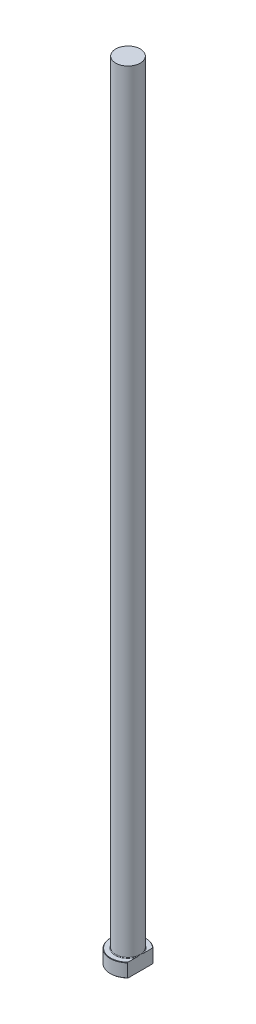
ISO-10303-21;
HEADER;
FILE_DESCRIPTION(('STEP AP214'),'2;1');
FILE_NAME('part.step','',(''),(''),'','','');
FILE_SCHEMA(('AUTOMOTIVE_DESIGN { 1 0 10303 214 1 1 1 1 }'));
ENDSEC;
DATA;
#1=APPLICATION_CONTEXT('core data for automotive mechanical design processes');
#2=APPLICATION_PROTOCOL_DEFINITION('international standard','automotive_design',2000,#1);
#3=PRODUCT_CONTEXT('',#1,'mechanical');
#4=PRODUCT('Part','Part','',(#3));
#5=PRODUCT_RELATED_PRODUCT_CATEGORY('part','',(#4));
#6=PRODUCT_DEFINITION_FORMATION('','',#4);
#7=PRODUCT_DEFINITION_CONTEXT('part definition',#1,'design');
#8=PRODUCT_DEFINITION('design','',#6,#7);
#9=PRODUCT_DEFINITION_SHAPE('','',#8);
#10=(LENGTH_UNIT() NAMED_UNIT(*) SI_UNIT(.MILLI.,.METRE.));
#11=(NAMED_UNIT(*) PLANE_ANGLE_UNIT() SI_UNIT($,.RADIAN.));
#12=(NAMED_UNIT(*) SI_UNIT($,.STERADIAN.) SOLID_ANGLE_UNIT());
#13=UNCERTAINTY_MEASURE_WITH_UNIT(LENGTH_MEASURE(1.E-05),#10,'distance_accuracy_value','');
#14=(GEOMETRIC_REPRESENTATION_CONTEXT(3) GLOBAL_UNCERTAINTY_ASSIGNED_CONTEXT((#13)) GLOBAL_UNIT_ASSIGNED_CONTEXT((#10,
#11,#12)) REPRESENTATION_CONTEXT('',''));
#15=CARTESIAN_POINT('',(0.,0.,0.));
#16=DIRECTION('',(0.,0.,1.));
#17=DIRECTION('',(1.,0.,0.));
#18=AXIS2_PLACEMENT_3D('',#15,#16,#17);
#19=CARTESIAN_POINT('',(0.,0.,0.));
#20=DIRECTION('',(0.,-1.,0.));
#21=DIRECTION('',(0.,0.,-1.));
#22=AXIS2_PLACEMENT_3D('',#19,#20,#21);
#23=PLANE('',#22);
#24=CARTESIAN_POINT('',(0.,0.,0.));
#25=DIRECTION('',(0.,-1.,0.));
#26=DIRECTION('',(0.,0.,-1.));
#27=AXIS2_PLACEMENT_3D('',#24,#25,#26);
#28=CIRCLE('',#27,8.79999999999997);
#29=CARTESIAN_POINT('',(6.24999999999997,0.,6.19495762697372));
#30=VERTEX_POINT('',#29);
#31=CARTESIAN_POINT('',(6.24999999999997,0.,-6.19495762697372));
#32=VERTEX_POINT('',#31);
#33=EDGE_CURVE('E98',#30,#32,#28,.T.);
#34=ORIENTED_EDGE('',*,*,#33,.T.);
#35=DIRECTION('',(0.,0.,1.));
#36=VECTOR('',#35,1.);
#37=CARTESIAN_POINT('',(6.24999999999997,0.,-6.47591692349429));
#38=LINE('',#37,#36);
#39=EDGE_CURVE('E83',#32,#30,#38,.T.);
#40=ORIENTED_EDGE('',*,*,#39,.T.);
#41=EDGE_LOOP('',(#34,#40));
#42=FACE_BOUND('',#41,.T.);
#43=ADVANCED_FACE('F32',(#42),#23,.T.);
#44=CARTESIAN_POINT('',(0.,259.958771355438,0.));
#45=DIRECTION('',(0.,1.,0.));
#46=DIRECTION('',(0.,0.,1.));
#47=AXIS2_PLACEMENT_3D('',#44,#45,#46);
#48=CYLINDRICAL_SURFACE('',#47,8.99999999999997);
#49=CARTESIAN_POINT('',(0.,6.79999999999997,0.));
#50=DIRECTION('',(0.,1.,0.));
#51=DIRECTION('',(0.,0.,1.));
#52=AXIS2_PLACEMENT_3D('',#49,#50,#51);
#53=CIRCLE('',#52,8.99999999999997);
#54=CARTESIAN_POINT('',(6.24999999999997,6.79999999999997,6.47591692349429));
#55=VERTEX_POINT('',#54);
#56=CARTESIAN_POINT('',(6.24999999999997,6.79999999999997,-6.47591692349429));
#57=VERTEX_POINT('',#56);
#58=EDGE_CURVE('E104',#55,#57,#53,.F.);
#59=ORIENTED_EDGE('',*,*,#58,.T.);
#60=DIRECTION('',(0.,-1.,0.));
#61=VECTOR('',#60,1.);
#62=CARTESIAN_POINT('',(6.24999999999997,400.,-6.47591692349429));
#63=LINE('',#62,#61);
#64=CARTESIAN_POINT('',(6.24999999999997,0.200000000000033,-6.47591692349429));
#65=VERTEX_POINT('',#64);
#66=EDGE_CURVE('E183',#57,#65,#63,.T.);
#67=ORIENTED_EDGE('',*,*,#66,.T.);
#68=CARTESIAN_POINT('',(0.,0.200000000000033,0.));
#69=DIRECTION('',(0.,-1.,0.));
#70=DIRECTION('',(0.,0.,-1.));
#71=AXIS2_PLACEMENT_3D('',#68,#69,#70);
#72=CIRCLE('',#71,8.99999999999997);
#73=CARTESIAN_POINT('',(6.24999999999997,0.200000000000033,6.47591692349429));
#74=VERTEX_POINT('',#73);
#75=EDGE_CURVE('E100',#65,#74,#72,.F.);
#76=ORIENTED_EDGE('',*,*,#75,.T.);
#77=DIRECTION('',(0.,-1.,0.));
#78=VECTOR('',#77,1.);
#79=CARTESIAN_POINT('',(6.24999999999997,400.,6.47591692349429));
#80=LINE('',#79,#78);
#81=EDGE_CURVE('E93',#55,#74,#80,.T.);
#82=ORIENTED_EDGE('',*,*,#81,.F.);
#83=EDGE_LOOP('',(#59,#67,#76,#82));
#84=FACE_BOUND('',#83,.T.);
#85=ADVANCED_FACE('F158',(#84),#48,.T.);
#86=CARTESIAN_POINT('',(-8.99999999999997,7.,0.));
#87=DIRECTION('',(0.,1.,0.));
#88=DIRECTION('',(0.,0.,1.));
#89=AXIS2_PLACEMENT_3D('',#86,#87,#88);
#90=PLANE('',#89);
#91=CARTESIAN_POINT('',(0.,7.,0.));
#92=DIRECTION('',(0.,1.,0.));
#93=DIRECTION('',(0.,0.,1.));
#94=AXIS2_PLACEMENT_3D('',#91,#92,#93);
#95=CIRCLE('',#94,8.79999999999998);
#96=CARTESIAN_POINT('',(6.24999999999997,7.,-6.19495762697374));
#97=VERTEX_POINT('',#96);
#98=CARTESIAN_POINT('',(6.24999999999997,7.,6.19495762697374));
#99=VERTEX_POINT('',#98);
#100=EDGE_CURVE('E178',#97,#99,#95,.T.);
#101=ORIENTED_EDGE('',*,*,#100,.T.);
#102=DIRECTION('',(0.,0.,-1.));
#103=VECTOR('',#102,1.);
#104=CARTESIAN_POINT('',(6.24999999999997,7.,0.));
#105=LINE('',#104,#103);
#106=CARTESIAN_POINT('',(6.24999999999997,6.99999999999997,1.95959179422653));
#107=VERTEX_POINT('',#106);
#108=EDGE_CURVE('E57',#99,#107,#105,.T.);
#109=ORIENTED_EDGE('',*,*,#108,.T.);
#110=CARTESIAN_POINT('',(0.,7.,0.));
#111=DIRECTION('',(0.,1.,0.));
#112=DIRECTION('',(0.,0.,1.));
#113=AXIS2_PLACEMENT_3D('',#110,#111,#112);
#114=CIRCLE('',#113,6.54999999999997);
#115=CARTESIAN_POINT('',(6.24999999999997,6.99999999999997,-1.95959179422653));
#116=VERTEX_POINT('',#115);
#117=EDGE_CURVE('E107',#107,#116,#114,.F.);
#118=ORIENTED_EDGE('',*,*,#117,.T.);
#119=EDGE_CURVE('E136',#116,#97,#105,.T.);
#120=ORIENTED_EDGE('',*,*,#119,.T.);
#121=EDGE_LOOP('',(#101,#109,#118,#120));
#122=FACE_BOUND('',#121,.T.);
#123=ADVANCED_FACE('F147',(#122),#90,.T.);
#124=CARTESIAN_POINT('',(0.,7.00000000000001,0.));
#125=DIRECTION('',(0.,-1.,0.));
#126=DIRECTION('',(0.,0.,-1.));
#127=AXIS2_PLACEMENT_3D('',#124,#125,#126);
#128=CONICAL_SURFACE('',#127,8.79999999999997,0.785398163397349);
#129=ORIENTED_EDGE('',*,*,#58,.F.);
#130=CARTESIAN_POINT('',(6.24999999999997,0.241333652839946,14.2481436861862));
#131=CARTESIAN_POINT('',(6.24999999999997,0.433510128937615,14.0382871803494));
#132=CARTESIAN_POINT('',(6.24999999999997,0.625318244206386,13.8280934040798));
#133=CARTESIAN_POINT('',(6.24999999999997,1.00808847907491,13.4069339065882));
#134=CARTESIAN_POINT('',(6.24999999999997,1.19905059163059,13.1959681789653));
#135=CARTESIAN_POINT('',(6.24999999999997,1.77058893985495,12.561672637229));
#136=CARTESIAN_POINT('',(6.24999999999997,2.14972657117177,12.1370432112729));
#137=CARTESIAN_POINT('',(6.24999999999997,2.90544742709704,11.2804244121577));
#138=CARTESIAN_POINT('',(6.24999999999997,3.28199640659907,10.848404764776));
#139=CARTESIAN_POINT('',(6.24999999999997,4.02800319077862,9.97835973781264));
#140=CARTESIAN_POINT('',(6.24999999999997,4.39746188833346,9.5403351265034));
#141=CARTESIAN_POINT('',(6.24999999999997,5.06619556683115,8.7290203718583));
#142=CARTESIAN_POINT('',(6.24999999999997,5.36698522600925,8.35698524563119));
#143=CARTESIAN_POINT('',(6.24999999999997,5.81091107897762,7.79312105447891));
#144=CARTESIAN_POINT('',(6.24999999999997,5.95769918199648,7.60416746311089));
#145=CARTESIAN_POINT('',(6.24999999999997,6.24834991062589,7.22402635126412));
#146=CARTESIAN_POINT('',(6.24999999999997,6.39221261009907,7.03283888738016));
#147=CARTESIAN_POINT('',(6.24999999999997,6.67624882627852,6.64809388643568));
#148=CARTESIAN_POINT('',(6.24999999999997,6.81642658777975,6.45453948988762));
#149=CARTESIAN_POINT('',(6.24999999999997,7.09250069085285,6.06440831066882));
#150=CARTESIAN_POINT('',(6.24999999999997,7.22839726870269,5.86783169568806));
#151=CARTESIAN_POINT('',(6.24999999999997,7.49487226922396,5.47121725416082));
#152=CARTESIAN_POINT('',(6.24999999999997,7.62545297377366,5.27118096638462));
#153=CARTESIAN_POINT('',(6.24999999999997,7.8800575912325,4.86699392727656));
#154=CARTESIAN_POINT('',(6.24999999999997,8.0040823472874,4.66284370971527));
#155=CARTESIAN_POINT('',(6.24999999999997,8.24192682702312,4.25315549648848));
#156=CARTESIAN_POINT('',(6.24999999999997,8.35588135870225,4.04769623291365));
#157=CARTESIAN_POINT('',(6.24999999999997,8.5737612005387,3.63145654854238));
#158=CARTESIAN_POINT('',(6.24999999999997,8.67768550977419,3.42067559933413));
#159=CARTESIAN_POINT('',(6.24999999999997,8.87268822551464,2.99352725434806));
#160=CARTESIAN_POINT('',(6.24999999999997,8.96378316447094,2.77716748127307));
#161=CARTESIAN_POINT('',(6.24999999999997,9.12997532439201,2.33835397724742));
#162=CARTESIAN_POINT('',(6.24999999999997,9.20507709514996,2.11590199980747));
#163=CARTESIAN_POINT('',(6.24999999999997,9.32245998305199,1.71047588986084));
#164=CARTESIAN_POINT('',(6.24999999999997,9.36830307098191,1.52853906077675));
#165=CARTESIAN_POINT('',(6.24999999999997,9.44550018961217,1.16159607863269));
#166=CARTESIAN_POINT('',(6.24999999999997,9.4768562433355,0.97659035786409));
#167=CARTESIAN_POINT('',(6.24999999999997,9.5234834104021,0.605004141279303));
#168=CARTESIAN_POINT('',(6.24999999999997,9.53879458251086,0.418428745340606));
#169=CARTESIAN_POINT('',(6.24999999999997,9.552630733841,0.0446485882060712));
#170=CARTESIAN_POINT('',(6.24999999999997,9.55115595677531,-0.142556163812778));
#171=CARTESIAN_POINT('',(6.24999999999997,9.53151010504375,-0.515964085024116));
#172=CARTESIAN_POINT('',(6.24999999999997,9.51334871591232,-0.702167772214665));
#173=CARTESIAN_POINT('',(6.24999999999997,9.46132296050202,-1.07235055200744));
#174=CARTESIAN_POINT('',(6.24999999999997,9.42745724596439,-1.25632945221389));
#175=CARTESIAN_POINT('',(6.24999999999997,9.34551825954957,-1.62161387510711));
#176=CARTESIAN_POINT('',(6.24999999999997,9.29740414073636,-1.80291011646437));
#177=CARTESIAN_POINT('',(6.24999999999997,9.1889194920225,-2.16174722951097));
#178=CARTESIAN_POINT('',(6.24999999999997,9.1285491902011,-2.33928817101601));
#179=CARTESIAN_POINT('',(6.24999999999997,8.98038960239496,-2.73619642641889));
#180=CARTESIAN_POINT('',(6.24999999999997,8.88955370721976,-2.95442044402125));
#181=CARTESIAN_POINT('',(6.24999999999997,8.69480317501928,-3.3850000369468));
#182=CARTESIAN_POINT('',(6.24999999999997,8.59088203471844,-3.59735262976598));
#183=CARTESIAN_POINT('',(6.24999999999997,8.37253952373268,-4.01706977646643));
#184=CARTESIAN_POINT('',(6.24999999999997,8.25809823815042,-4.22442389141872));
#185=CARTESIAN_POINT('',(6.24999999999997,8.02107167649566,-4.63434772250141));
#186=CARTESIAN_POINT('',(6.24999999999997,7.898487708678,-4.83691820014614));
#187=CARTESIAN_POINT('',(6.24999999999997,7.64548625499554,-5.24008406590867));
#188=CARTESIAN_POINT('',(6.24999999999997,7.51499955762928,-5.4406358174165));
#189=CARTESIAN_POINT('',(6.24999999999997,7.24868510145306,-5.83817237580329));
#190=CARTESIAN_POINT('',(6.24999999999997,7.11285688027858,-6.03515687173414));
#191=CARTESIAN_POINT('',(6.24999999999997,6.83683288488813,-6.42612120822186));
#192=CARTESIAN_POINT('',(6.24999999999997,6.69663581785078,-6.62010013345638));
#193=CARTESIAN_POINT('',(6.24999999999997,6.41268260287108,-7.00543858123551));
#194=CARTESIAN_POINT('',(6.24999999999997,6.26892633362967,-7.19679801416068));
#195=CARTESIAN_POINT('',(6.24999999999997,5.89056224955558,-7.69242940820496));
#196=CARTESIAN_POINT('',(6.24999999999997,5.65363599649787,-7.99493062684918));
#197=CARTESIAN_POINT('',(6.24999999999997,5.17412949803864,-8.59529922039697));
#198=CARTESIAN_POINT('',(6.24999999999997,4.93155037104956,-8.89316749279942));
#199=CARTESIAN_POINT('',(6.24999999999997,4.44181409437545,-9.48544309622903));
#200=CARTESIAN_POINT('',(6.24999999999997,4.19465400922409,-9.77984799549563));
#201=CARTESIAN_POINT('',(6.24999999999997,3.69683790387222,-10.3657062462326));
#202=CARTESIAN_POINT('',(6.24999999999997,3.44618171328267,-10.6571594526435));
#203=CARTESIAN_POINT('',(6.24999999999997,2.95199448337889,-11.2262122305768));
#204=CARTESIAN_POINT('',(6.24999999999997,2.7085712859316,-11.5039055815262));
#205=CARTESIAN_POINT('',(6.24999999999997,2.21961081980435,-12.0574158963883));
#206=CARTESIAN_POINT('',(6.24999999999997,1.97407358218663,-12.3332328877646));
#207=CARTESIAN_POINT('',(6.24999999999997,1.48150971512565,-12.8829958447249));
#208=CARTESIAN_POINT('',(6.24999999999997,1.23448497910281,-13.1569435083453));
#209=CARTESIAN_POINT('',(6.24999999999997,0.738953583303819,-13.7034947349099));
#210=CARTESIAN_POINT('',(6.24999999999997,0.490446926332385,-13.9760983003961));
#211=CARTESIAN_POINT('',(6.24999999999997,0.241333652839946,-14.2481436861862));
#212=B_SPLINE_CURVE_WITH_KNOTS('',3,(#130,#131,#132,#133,#134,#135,#136,#137,#138,#139,#140,
#141,#142,#143,#144,#145,#146,#147,#148,#149,#150,#151,#152,#153,#154,#155,#156,#157,#158,#159,
#160,#161,#162,#163,#164,#165,#166,#167,#168,#169,#170,#171,#172,#173,#174,#175,#176,#177,#178,
#179,#180,#181,#182,#183,#184,#185,#186,#187,#188,#189,#190,#191,#192,#193,#194,#195,#196,#197,
#198,#199,#200,#201,#202,#203,#204,#205,#206,#207,#208,#209,#210,#211),.UNSPECIFIED.,.F.,.F.,(4,
2,2,2,2,2,2,2,2,2,2,2,2,2,2,2,2,2,2,2,2,2,2,2,2,2,2,2,2,2,2,2,2,2,2,2,2,2,2,2,4),(0.,
0.853664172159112,1.7073354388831,3.41508002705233,5.13429133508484,6.8532847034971,
8.28840776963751,9.00619588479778,9.72396585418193,10.4408691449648,11.1577328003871,
11.8742854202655,12.5907456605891,13.295361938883,14.0000484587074,14.7038184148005,
15.4073878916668,15.9697505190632,16.5320345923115,17.0929114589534,17.6537801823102,
18.2143235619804,18.7749150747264,19.3371294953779,19.8993334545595,20.6078926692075,
21.3168054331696,22.0270889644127,22.7372586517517,23.4549493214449,24.1727022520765,
24.8906696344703,25.6086615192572,26.7612833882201,27.9136791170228,29.0668407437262,
30.2200587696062,31.3278889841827,32.4357029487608,33.5423213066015,34.6489375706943),.UNSPECIFIED.);
#213=EDGE_CURVE('E135',#55,#99,#212,.T.);
#214=ORIENTED_EDGE('',*,*,#213,.T.);
#215=ORIENTED_EDGE('',*,*,#100,.F.);
#216=EDGE_CURVE('E127',#97,#57,#212,.T.);
#217=ORIENTED_EDGE('',*,*,#216,.T.);
#218=EDGE_LOOP('',(#129,#214,#215,#217));
#219=FACE_BOUND('',#218,.T.);
#220=ADVANCED_FACE('F143',(#219),#128,.T.);
#221=CARTESIAN_POINT('',(0.,0.200000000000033,0.));
#222=DIRECTION('',(0.,1.,0.));
#223=DIRECTION('',(0.,0.,1.));
#224=AXIS2_PLACEMENT_3D('',#221,#222,#223);
#225=CONICAL_SURFACE('',#224,8.99999999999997,0.785398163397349);
#226=ORIENTED_EDGE('',*,*,#75,.F.);
#227=CARTESIAN_POINT('',(6.24999999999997,6.75866634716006,-14.2481436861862));
#228=CARTESIAN_POINT('',(6.24999999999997,6.56648987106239,-14.0382871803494));
#229=CARTESIAN_POINT('',(6.24999999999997,6.37468175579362,-13.8280934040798));
#230=CARTESIAN_POINT('',(6.24999999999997,5.99191152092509,-13.4069339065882));
#231=CARTESIAN_POINT('',(6.24999999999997,5.80094940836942,-13.1959681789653));
#232=CARTESIAN_POINT('',(6.24999999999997,5.22941106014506,-12.561672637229));
#233=CARTESIAN_POINT('',(6.24999999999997,4.85027342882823,-12.1370432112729));
#234=CARTESIAN_POINT('',(6.24999999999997,4.09455257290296,-11.2804244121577));
#235=CARTESIAN_POINT('',(6.24999999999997,3.71800359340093,-10.848404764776));
#236=CARTESIAN_POINT('',(6.24999999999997,2.97199680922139,-9.97835973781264));
#237=CARTESIAN_POINT('',(6.24999999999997,2.60253811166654,-9.5403351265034));
#238=CARTESIAN_POINT('',(6.24999999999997,1.93380443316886,-8.7290203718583));
#239=CARTESIAN_POINT('',(6.24999999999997,1.63301477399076,-8.35698524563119));
#240=CARTESIAN_POINT('',(6.24999999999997,1.18908892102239,-7.79312105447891));
#241=CARTESIAN_POINT('',(6.24999999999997,1.04230081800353,-7.60416746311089));
#242=CARTESIAN_POINT('',(6.24999999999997,0.75165008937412,-7.22402635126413));
#243=CARTESIAN_POINT('',(6.24999999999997,0.607787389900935,-7.03283888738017));
#244=CARTESIAN_POINT('',(6.24999999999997,0.323751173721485,-6.64809388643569));
#245=CARTESIAN_POINT('',(6.24999999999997,0.183573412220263,-6.45453948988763));
#246=CARTESIAN_POINT('',(6.24999999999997,-0.0925006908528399,-6.06440831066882));
#247=CARTESIAN_POINT('',(6.24999999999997,-0.228397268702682,-5.86783169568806));
#248=CARTESIAN_POINT('',(6.24999999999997,-0.494872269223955,-5.47121725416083));
#249=CARTESIAN_POINT('',(6.24999999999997,-0.625452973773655,-5.27118096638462));
#250=CARTESIAN_POINT('',(6.24999999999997,-0.880057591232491,-4.86699392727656));
#251=CARTESIAN_POINT('',(6.24999999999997,-1.00408234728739,-4.66284370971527));
#252=CARTESIAN_POINT('',(6.24999999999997,-1.24192682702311,-4.25315549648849));
#253=CARTESIAN_POINT('',(6.24999999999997,-1.35588135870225,-4.04769623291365));
#254=CARTESIAN_POINT('',(6.24999999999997,-1.57376120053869,-3.63145654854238));
#255=CARTESIAN_POINT('',(6.24999999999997,-1.67768550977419,-3.42067559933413));
#256=CARTESIAN_POINT('',(6.24999999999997,-1.87268822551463,-2.99352725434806));
#257=CARTESIAN_POINT('',(6.24999999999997,-1.96378316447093,-2.77716748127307));
#258=CARTESIAN_POINT('',(6.24999999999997,-2.129975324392,-2.33835397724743));
#259=CARTESIAN_POINT('',(6.24999999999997,-2.20507709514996,-2.11590199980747));
#260=CARTESIAN_POINT('',(6.24999999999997,-2.32245998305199,-1.71047588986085));
#261=CARTESIAN_POINT('',(6.24999999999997,-2.3683030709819,-1.52853906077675));
#262=CARTESIAN_POINT('',(6.24999999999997,-2.44550018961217,-1.1615960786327));
#263=CARTESIAN_POINT('',(6.24999999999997,-2.47685624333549,-0.976590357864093));
#264=CARTESIAN_POINT('',(6.24999999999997,-2.52348341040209,-0.605004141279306));
#265=CARTESIAN_POINT('',(6.24999999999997,-2.53879458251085,-0.418428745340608));
#266=CARTESIAN_POINT('',(6.24999999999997,-2.552630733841,-0.0446485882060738));
#267=CARTESIAN_POINT('',(6.24999999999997,-2.55115595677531,0.142556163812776));
#268=CARTESIAN_POINT('',(6.24999999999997,-2.53151010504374,0.515964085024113));
#269=CARTESIAN_POINT('',(6.24999999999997,-2.51334871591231,0.702167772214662));
#270=CARTESIAN_POINT('',(6.24999999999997,-2.46132296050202,1.07235055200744));
#271=CARTESIAN_POINT('',(6.24999999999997,-2.42745724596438,1.25632945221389));
#272=CARTESIAN_POINT('',(6.24999999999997,-2.34551825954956,1.62161387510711));
#273=CARTESIAN_POINT('',(6.24999999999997,-2.29740414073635,1.80291011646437));
#274=CARTESIAN_POINT('',(6.24999999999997,-2.1889194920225,2.16174722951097));
#275=CARTESIAN_POINT('',(6.24999999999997,-2.1285491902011,2.33928817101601));
#276=CARTESIAN_POINT('',(6.24999999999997,-1.98038960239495,2.73619642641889));
#277=CARTESIAN_POINT('',(6.24999999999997,-1.88955370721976,2.95442044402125));
#278=CARTESIAN_POINT('',(6.24999999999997,-1.69480317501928,3.3850000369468));
#279=CARTESIAN_POINT('',(6.24999999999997,-1.59088203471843,3.59735262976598));
#280=CARTESIAN_POINT('',(6.24999999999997,-1.37253952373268,4.01706977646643));
#281=CARTESIAN_POINT('',(6.24999999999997,-1.25809823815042,4.22442389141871));
#282=CARTESIAN_POINT('',(6.24999999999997,-1.02107167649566,4.6343477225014));
#283=CARTESIAN_POINT('',(6.24999999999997,-0.898487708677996,4.83691820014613));
#284=CARTESIAN_POINT('',(6.24999999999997,-0.645486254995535,5.24008406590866));
#285=CARTESIAN_POINT('',(6.24999999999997,-0.514999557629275,5.4406358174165));
#286=CARTESIAN_POINT('',(6.24999999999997,-0.24868510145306,5.83817237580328));
#287=CARTESIAN_POINT('',(6.24999999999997,-0.112856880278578,6.03515687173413));
#288=CARTESIAN_POINT('',(6.24999999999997,0.163167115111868,6.42612120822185));
#289=CARTESIAN_POINT('',(6.24999999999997,0.30336418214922,6.62010013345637));
#290=CARTESIAN_POINT('',(6.24999999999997,0.587317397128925,7.00543858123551));
#291=CARTESIAN_POINT('',(6.24999999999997,0.731073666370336,7.19679801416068));
#292=CARTESIAN_POINT('',(6.24999999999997,1.10943775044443,7.69242940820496));
#293=CARTESIAN_POINT('',(6.24999999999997,1.34636400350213,7.99493062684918));
#294=CARTESIAN_POINT('',(6.24999999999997,1.82587050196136,8.59529922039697));
#295=CARTESIAN_POINT('',(6.24999999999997,2.06844962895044,8.89316749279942));
#296=CARTESIAN_POINT('',(6.24999999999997,2.55818590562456,9.48544309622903));
#297=CARTESIAN_POINT('',(6.24999999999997,2.80534599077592,9.77984799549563));
#298=CARTESIAN_POINT('',(6.24999999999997,3.30316209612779,10.3657062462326));
#299=CARTESIAN_POINT('',(6.24999999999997,3.55381828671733,10.6571594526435));
#300=CARTESIAN_POINT('',(6.24999999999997,4.04800551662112,11.2262122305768));
#301=CARTESIAN_POINT('',(6.24999999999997,4.29142871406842,11.5039055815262));
#302=CARTESIAN_POINT('',(6.24999999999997,4.78038918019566,12.0574158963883));
#303=CARTESIAN_POINT('',(6.24999999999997,5.02592641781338,12.3332328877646));
#304=CARTESIAN_POINT('',(6.24999999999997,5.51849028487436,12.8829958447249));
#305=CARTESIAN_POINT('',(6.24999999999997,5.7655150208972,13.1569435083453));
#306=CARTESIAN_POINT('',(6.24999999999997,6.26104641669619,13.7034947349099));
#307=CARTESIAN_POINT('',(6.24999999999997,6.50955307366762,13.9760983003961));
#308=CARTESIAN_POINT('',(6.24999999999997,6.75866634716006,14.2481436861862));
#309=B_SPLINE_CURVE_WITH_KNOTS('',3,(#227,#228,#229,#230,#231,#232,#233,#234,#235,#236,#237,
#238,#239,#240,#241,#242,#243,#244,#245,#246,#247,#248,#249,#250,#251,#252,#253,#254,#255,#256,
#257,#258,#259,#260,#261,#262,#263,#264,#265,#266,#267,#268,#269,#270,#271,#272,#273,#274,#275,
#276,#277,#278,#279,#280,#281,#282,#283,#284,#285,#286,#287,#288,#289,#290,#291,#292,#293,#294,
#295,#296,#297,#298,#299,#300,#301,#302,#303,#304,#305,#306,#307,#308),.UNSPECIFIED.,.F.,.F.,(4,
2,2,2,2,2,2,2,2,2,2,2,2,2,2,2,2,2,2,2,2,2,2,2,2,2,2,2,2,2,2,2,2,2,2,2,2,2,2,2,4),(0.,
0.85366417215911,1.7073354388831,3.41508002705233,5.13429133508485,6.8532847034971,
8.28840776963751,9.00619588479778,9.72396585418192,10.4408691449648,11.1577328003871,
11.8742854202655,12.5907456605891,13.295361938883,14.0000484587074,14.7038184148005,
15.4073878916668,15.9697505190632,16.5320345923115,17.0929114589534,17.6537801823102,
18.2143235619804,18.7749150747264,19.3371294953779,19.8993334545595,20.6078926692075,
21.3168054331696,22.0270889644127,22.7372586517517,23.4549493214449,24.1727022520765,
24.8906696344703,25.6086615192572,26.7612833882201,27.9136791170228,29.0668407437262,
30.2200587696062,31.3278889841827,32.4357029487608,33.5423213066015,34.6489375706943),.UNSPECIFIED.);
#310=EDGE_CURVE('E86',#65,#32,#309,.T.);
#311=ORIENTED_EDGE('',*,*,#310,.T.);
#312=ORIENTED_EDGE('',*,*,#33,.F.);
#313=EDGE_CURVE('E89',#30,#74,#309,.T.);
#314=ORIENTED_EDGE('',*,*,#313,.T.);
#315=EDGE_LOOP('',(#226,#311,#312,#314));
#316=FACE_BOUND('',#315,.T.);
#317=ADVANCED_FACE('F97',(#316),#225,.T.);
#318=CARTESIAN_POINT('',(0.,7.29999999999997,0.));
#319=DIRECTION('',(0.,1.,0.));
#320=DIRECTION('',(0.,0.,1.));
#321=AXIS2_PLACEMENT_3D('',#318,#319,#320);
#322=TOROIDAL_SURFACE('',#321,6.54999999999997,0.3);
#323=CARTESIAN_POINT('',(6.24999999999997,7.29999999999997,0.));
#324=CARTESIAN_POINT('',(6.24999999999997,7.30000062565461,1.07935811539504E-10));
#325=CARTESIAN_POINT('',(6.24999999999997,7.30000125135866,-2.93503388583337E-07));
#326=CARTESIAN_POINT('',(6.24999999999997,7.300002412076,-1.07409020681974E-06));
#327=CARTESIAN_POINT('',(6.24999999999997,7.30000292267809,-1.58214987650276E-06));
#328=CARTESIAN_POINT('',(6.24999999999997,7.30000400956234,-2.8081901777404E-06));
#329=CARTESIAN_POINT('',(6.24999999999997,7.30000456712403,-3.54604295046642E-06));
#330=CARTESIAN_POINT('',(6.24999999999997,7.30000554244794,-5.05412397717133E-06));
#331=CARTESIAN_POINT('',(6.24999999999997,7.30000596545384,-5.82130991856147E-06));
#332=CARTESIAN_POINT('',(6.24999999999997,7.30000759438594,-8.87270548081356E-06));
#333=CARTESIAN_POINT('',(6.24999999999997,7.30000872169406,-1.1203275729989E-05));
#334=CARTESIAN_POINT('',(6.24999999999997,7.30001051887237,-1.57552363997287E-05));
#335=CARTESIAN_POINT('',(6.24999999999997,7.30001122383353,-1.79632548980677E-05));
#336=CARTESIAN_POINT('',(6.24999999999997,7.30001427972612,-2.752581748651E-05));
#337=CARTESIAN_POINT('',(6.24999999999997,7.30001663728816,-3.48805238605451E-05));
#338=CARTESIAN_POINT('',(6.24999999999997,7.30002001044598,-4.8619148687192E-05));
#339=CARTESIAN_POINT('',(6.24999999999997,7.30002118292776,-5.49639235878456E-05));
#340=CARTESIAN_POINT('',(6.24999999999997,7.30002986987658,-0.000102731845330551));
#341=CARTESIAN_POINT('',(6.24999999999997,7.30003662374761,-0.000144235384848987));
#342=CARTESIAN_POINT('',(6.24999999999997,7.30006617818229,-0.000309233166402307));
#343=CARTESIAN_POINT('',(6.24999999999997,7.3000942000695,-0.000431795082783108));
#344=CARTESIAN_POINT('',(6.24999999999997,7.30020410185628,-0.000919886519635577));
#345=CARTESIAN_POINT('',(6.24999999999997,7.3002827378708,-0.00128589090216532));
#346=CARTESIAN_POINT('',(6.24999999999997,7.30059929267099,-0.00274922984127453));
#347=CARTESIAN_POINT('',(6.24999999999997,7.30084138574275,-0.00384592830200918));
#348=CARTESIAN_POINT('',(6.24999999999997,7.30185366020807,-0.00844291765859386));
#349=CARTESIAN_POINT('',(6.24999999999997,7.30261854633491,-0.0119440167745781));
#350=CARTESIAN_POINT('',(6.24999999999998,7.30934535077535,-0.0427197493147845));
#351=CARTESIAN_POINT('',(6.24999999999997,7.31532845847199,-0.0699912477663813));
#352=CARTESIAN_POINT('',(6.24999999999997,7.32701994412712,-0.1234289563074));
#353=CARTESIAN_POINT('',(6.24999999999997,7.33272958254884,-0.14959492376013));
#354=CARTESIAN_POINT('',(6.24999999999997,7.34485779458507,-0.205323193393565));
#355=CARTESIAN_POINT('',(6.24999999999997,7.35127239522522,-0.23488638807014));
#356=CARTESIAN_POINT('',(6.24999999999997,7.36411066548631,-0.294356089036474));
#357=CARTESIAN_POINT('',(6.24999999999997,7.37053363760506,-0.324262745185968));
#358=CARTESIAN_POINT('',(6.24999999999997,7.38584616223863,-0.396051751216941));
#359=CARTESIAN_POINT('',(6.24999999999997,7.39469543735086,-0.437942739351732));
#360=CARTESIAN_POINT('',(6.24999999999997,7.41192932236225,-0.520630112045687));
#361=CARTESIAN_POINT('',(6.24999999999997,7.42032002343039,-0.561425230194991));
#362=CARTESIAN_POINT('',(6.24999999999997,7.44742205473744,-0.69545636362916));
#363=CARTESIAN_POINT('',(6.24999999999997,7.4655604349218,-0.788810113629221));
#364=CARTESIAN_POINT('',(6.24999999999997,7.49982037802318,-0.976827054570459));
#365=CARTESIAN_POINT('',(6.24999999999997,7.51592073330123,-1.07149417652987));
#366=CARTESIAN_POINT('',(6.24999999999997,7.54633300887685,-1.27034734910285));
#367=CARTESIAN_POINT('',(6.24999999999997,7.56032934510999,-1.37458266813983));
#368=CARTESIAN_POINT('',(6.24999999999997,7.58288660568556,-1.58337219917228));
#369=CARTESIAN_POINT('',(6.24999999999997,7.59146383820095,-1.68792449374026));
#370=CARTESIAN_POINT('',(6.24999999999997,7.59839530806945,-1.84328437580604));
#371=CARTESIAN_POINT('',(6.24999999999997,7.59974160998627,-1.89395725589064));
#372=CARTESIAN_POINT('',(6.24999999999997,7.60019235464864,-1.99536854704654));
#373=CARTESIAN_POINT('',(6.24999999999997,7.59929473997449,-2.04610697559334));
#374=CARTESIAN_POINT('',(6.24999999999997,7.59472992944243,-2.14676570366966));
#375=CARTESIAN_POINT('',(6.24999999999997,7.5911010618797,-2.19668764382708));
#376=CARTESIAN_POINT('',(6.24999999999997,7.58034281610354,-2.29612823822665));
#377=CARTESIAN_POINT('',(6.24999999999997,7.57321785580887,-2.3456473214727));
#378=CARTESIAN_POINT('',(6.24999999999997,7.55883861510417,-2.41968621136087));
#379=CARTESIAN_POINT('',(6.24999999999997,7.55336305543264,-2.44455073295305));
#380=CARTESIAN_POINT('',(6.24999999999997,7.54088765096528,-2.49388968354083));
#381=CARTESIAN_POINT('',(6.24999999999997,7.53388865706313,-2.51836432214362));
#382=CARTESIAN_POINT('',(6.24999999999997,7.5180160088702,-2.56658659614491));
#383=CARTESIAN_POINT('',(6.24999999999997,7.50915079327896,-2.59033697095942));
#384=CARTESIAN_POINT('',(6.24999999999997,7.48896575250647,-2.63675110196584));
#385=CARTESIAN_POINT('',(6.24999999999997,7.47765263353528,-2.65941762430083));
#386=CARTESIAN_POINT('',(6.24999999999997,7.45696632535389,-2.69385500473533));
#387=CARTESIAN_POINT('',(6.24999999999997,7.4486983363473,-2.70628406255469));
#388=CARTESIAN_POINT('',(6.24999999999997,7.43069170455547,-2.73004308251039));
#389=CARTESIAN_POINT('',(6.24999999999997,7.42095514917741,-2.74137456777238));
#390=CARTESIAN_POINT('',(6.24999999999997,7.40313125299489,-2.75886410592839));
#391=CARTESIAN_POINT('',(6.24999999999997,7.39552792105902,-2.76551055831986));
#392=CARTESIAN_POINT('',(6.24999999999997,7.37942171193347,-2.77761940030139));
#393=CARTESIAN_POINT('',(6.24999999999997,7.37092027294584,-2.78308364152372));
#394=CARTESIAN_POINT('',(6.24999999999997,7.3552039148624,-2.79123019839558));
#395=CARTESIAN_POINT('',(6.24999999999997,7.34817405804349,-2.79426565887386));
#396=CARTESIAN_POINT('',(6.24999999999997,7.33371058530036,-2.79914227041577));
#397=CARTESIAN_POINT('',(6.24999999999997,7.32627746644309,-2.80098485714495));
#398=CARTESIAN_POINT('',(6.24999999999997,7.31114486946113,-2.80329865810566));
#399=CARTESIAN_POINT('',(6.24999999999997,7.30344395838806,-2.8037607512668));
#400=CARTESIAN_POINT('',(6.24999999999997,7.28809169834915,-2.80323167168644));
#401=CARTESIAN_POINT('',(6.24999999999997,7.28044035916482,-2.8022402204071));
#402=CARTESIAN_POINT('',(6.24999999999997,7.26612892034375,-2.79907216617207));
#403=CARTESIAN_POINT('',(6.24999999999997,7.25944213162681,-2.79701213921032));
#404=CARTESIAN_POINT('',(6.24999999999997,7.24643877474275,-2.79195274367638));
#405=CARTESIAN_POINT('',(6.24999999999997,7.24012234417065,-2.78895302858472));
#406=CARTESIAN_POINT('',(6.24999999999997,7.2241404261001,-2.78010234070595));
#407=CARTESIAN_POINT('',(6.24999999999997,7.21481747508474,-2.77363492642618));
#408=CARTESIAN_POINT('',(6.24999999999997,7.19727307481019,-2.75934472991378));
#409=CARTESIAN_POINT('',(6.24999999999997,7.18905534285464,-2.75151756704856));
#410=CARTESIAN_POINT('',(6.24999999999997,7.16746274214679,-2.72838666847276));
#411=CARTESIAN_POINT('',(6.24999999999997,7.15517318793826,-2.71208063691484));
#412=CARTESIAN_POINT('',(6.24999999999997,7.13297830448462,-2.67797126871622));
#413=CARTESIAN_POINT('',(6.24999999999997,7.12307686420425,-2.66016555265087));
#414=CARTESIAN_POINT('',(6.24999999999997,7.10185271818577,-2.61712561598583));
#415=CARTESIAN_POINT('',(6.24999999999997,7.09129494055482,-2.59151849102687));
#416=CARTESIAN_POINT('',(6.24999999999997,7.07260379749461,-2.53941658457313));
#417=CARTESIAN_POINT('',(6.24999999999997,7.06447530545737,-2.51292013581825));
#418=CARTESIAN_POINT('',(6.24999999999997,7.05002040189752,-2.45908915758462));
#419=CARTESIAN_POINT('',(6.24999999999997,7.04371803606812,-2.43174827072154));
#420=CARTESIAN_POINT('',(6.24999999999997,7.03267951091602,-2.37679196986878));
#421=CARTESIAN_POINT('',(6.24999999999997,7.0279416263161,-2.34917689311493));
#422=CARTESIAN_POINT('',(6.24999999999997,7.01732549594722,-2.27736486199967));
#423=CARTESIAN_POINT('',(6.24999999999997,7.01243082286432,-2.23302306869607));
#424=CARTESIAN_POINT('',(6.24999999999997,7.00516057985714,-2.1441265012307));
#425=CARTESIAN_POINT('',(6.24999999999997,7.00278642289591,-2.099571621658));
#426=CARTESIAN_POINT('',(6.24999999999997,6.99868217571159,-1.96551117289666));
#427=CARTESIAN_POINT('',(6.24999999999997,7.0000072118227,-1.87591316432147));
#428=CARTESIAN_POINT('',(6.24999999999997,7.0080292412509,-1.70248618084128));
#429=CARTESIAN_POINT('',(6.24999999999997,7.01439439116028,-1.61863796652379));
#430=CARTESIAN_POINT('',(6.24999999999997,7.03083822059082,-1.45127006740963));
#431=CARTESIAN_POINT('',(6.24999999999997,7.04091883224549,-1.3677505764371));
#432=CARTESIAN_POINT('',(6.24999999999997,7.06480380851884,-1.19431308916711));
#433=CARTESIAN_POINT('',(6.24999999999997,7.07884475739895,-1.10442856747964));
#434=CARTESIAN_POINT('',(6.24999999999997,7.10969415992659,-0.922729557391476));
#435=CARTESIAN_POINT('',(6.24999999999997,7.12656524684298,-0.830925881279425));
#436=CARTESIAN_POINT('',(6.24999999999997,7.15670076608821,-0.67515179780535));
#437=CARTESIAN_POINT('',(6.24999999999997,7.16952837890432,-0.611095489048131));
#438=CARTESIAN_POINT('',(6.24999999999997,7.19564112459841,-0.483838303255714));
#439=CARTESIAN_POINT('',(6.24999999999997,7.2089193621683,-0.420636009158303));
#440=CARTESIAN_POINT('',(6.24999999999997,7.23428285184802,-0.301644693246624));
#441=CARTESIAN_POINT('',(6.24999999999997,7.24632762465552,-0.245846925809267));
#442=CARTESIAN_POINT('',(6.24999999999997,7.27113004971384,-0.131848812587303));
#443=CARTESIAN_POINT('',(6.24999999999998,7.28389583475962,-0.0736501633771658));
#444=CARTESIAN_POINT('',(6.24999999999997,7.29738281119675,-0.0119373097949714));
#445=CARTESIAN_POINT('',(6.24999999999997,7.29814924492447,-0.00842953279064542));
#446=CARTESIAN_POINT('',(6.24999999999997,7.2991618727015,-0.00383105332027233));
#447=CARTESIAN_POINT('',(6.24999999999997,7.29940281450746,-0.00273954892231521));
#448=CARTESIAN_POINT('',(6.24999999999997,7.29971797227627,-0.00128266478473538));
#449=CARTESIAN_POINT('',(6.24999999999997,7.29979633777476,-0.000917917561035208));
#450=CARTESIAN_POINT('',(6.24999999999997,7.29990591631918,-0.000431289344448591));
#451=CARTESIAN_POINT('',(6.24999999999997,7.29993389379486,-0.000308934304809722));
#452=CARTESIAN_POINT('',(6.24999999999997,7.29996340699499,-0.00014417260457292));
#453=CARTESIAN_POINT('',(6.24999999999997,7.29997015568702,-0.000102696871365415));
#454=CARTESIAN_POINT('',(6.24999999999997,7.29997883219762,-5.49575231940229E-05));
#455=CARTESIAN_POINT('',(6.24999999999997,7.29998000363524,-4.86141750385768E-05));
#456=CARTESIAN_POINT('',(6.24999999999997,7.29998337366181,-3.48785875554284E-05));
#457=CARTESIAN_POINT('',(6.24999999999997,7.29998572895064,-2.75254181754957E-05));
#458=CARTESIAN_POINT('',(6.24999999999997,7.29998878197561,-1.79644811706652E-05));
#459=CARTESIAN_POINT('',(6.24999999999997,7.29998948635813,-1.57565691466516E-05));
#460=CARTESIAN_POINT('',(6.24999999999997,7.29999128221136,-1.12047374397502E-05));
#461=CARTESIAN_POINT('',(6.24999999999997,7.29999240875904,-8.87417477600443E-06));
#462=CARTESIAN_POINT('',(6.24999999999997,7.29999403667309,-5.82269238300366E-06));
#463=CARTESIAN_POINT('',(6.24999999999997,7.29999445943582,-5.05545097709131E-06));
#464=CARTESIAN_POINT('',(6.24999999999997,7.29999543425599,-3.54721514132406E-06));
#465=CARTESIAN_POINT('',(6.24999999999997,7.29999599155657,-2.80926073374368E-06));
#466=CARTESIAN_POINT('',(6.24999999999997,7.29999707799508,-1.58298694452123E-06));
#467=CARTESIAN_POINT('',(6.24999999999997,7.29999758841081,-1.07480544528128E-06));
#468=CARTESIAN_POINT('',(6.24999999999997,7.29999874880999,-2.93902319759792E-07));
#469=CARTESIAN_POINT('',(6.24999999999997,7.29999937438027,-1.07929784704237E-10));
#470=CARTESIAN_POINT('',(6.24999999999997,7.29999999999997,0.));
#471=B_SPLINE_CURVE_WITH_KNOTS('',3,(#323,#324,#325,#326,#327,#328,#329,#330,#331,#332,#333,
#334,#335,#336,#337,#338,#339,#340,#341,#342,#343,#344,#345,#346,#347,#348,#349,#350,#351,#352,
#353,#354,#355,#356,#357,#358,#359,#360,#361,#362,#363,#364,#365,#366,#367,#368,#369,#370,#371,
#372,#373,#374,#375,#376,#377,#378,#379,#380,#381,#382,#383,#384,#385,#386,#387,#388,#389,#390,
#391,#392,#393,#394,#395,#396,#397,#398,#399,#400,#401,#402,#403,#404,#405,#406,#407,#408,#409,
#410,#411,#412,#413,#414,#415,#416,#417,#418,#419,#420,#421,#422,#423,#424,#425,#426,#427,#428,
#429,#430,#431,#432,#433,#434,#435,#436,#437,#438,#439,#440,#441,#442,#443,#444,#445,#446,#447,
#448,#449,#450,#451,#452,#453,#454,#455,#456,#457,#458,#459,#460,#461,#462,#463,#464,#465,#466,
#467,#468,#469,#470),.UNSPECIFIED.,.T.,.F.,(4,2,2,2,2,2,2,2,2,2,2,2,2,2,2,2,2,2,2,2,2,2,2,2,2,2,
2,2,2,2,2,2,2,2,2,2,2,2,2,2,2,2,2,2,2,2,2,2,2,2,2,2,2,2,2,2,2,2,2,2,2,2,2,2,2,2,2,2,2,2,2,2,2,
4),(0.,1.91133621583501E-06,4.08629145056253E-06,6.84045192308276E-06,9.46814795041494E-06,
1.72102324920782E-05,2.41571318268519E-05,4.72958844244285E-05,6.66312210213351E-05,
0.000192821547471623,0.000569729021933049,0.0016930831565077,0.00506203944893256,
0.0158134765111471,0.0995718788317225,0.17991734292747,0.270670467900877,0.362436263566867,
0.49088205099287,0.615829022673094,0.901110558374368,1.18915184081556,1.50457944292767,
1.81905322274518,1.97108855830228,2.1232633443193,2.27334154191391,2.42323057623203,
2.49957602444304,2.5758789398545,2.65184396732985,2.72760346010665,2.77231358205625,
2.81696074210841,2.84717821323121,2.87734800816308,2.90023250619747,2.92308941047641,
2.94609700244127,2.96910900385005,2.99001820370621,3.01093512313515,3.04477802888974,
3.07873205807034,3.13964269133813,3.20065185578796,3.28355317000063,3.36661969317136,
3.45073488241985,3.53475699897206,3.66848651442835,3.80229095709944,4.07081278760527,
4.32299246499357,4.57530346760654,4.8481846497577,5.12818350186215,5.32416473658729,
5.51790851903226,5.68915816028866,5.86790059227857,5.87867257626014,5.88202557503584,
5.88314507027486,5.88352134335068,5.88364744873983,5.88366677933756,5.88368991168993,
5.88369685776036,5.88370459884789,5.88370722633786,5.8837099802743,5.88371215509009,
5.88371406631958),.UNSPECIFIED.);
#472=CARTESIAN_POINT('',(6.24999999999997,7.29999999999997,0.));
#473=VERTEX_POINT('',#472);
#474=EDGE_CURVE('E11',#116,#473,#471,.T.);
#475=ORIENTED_EDGE('',*,*,#474,.F.);
#476=ORIENTED_EDGE('',*,*,#117,.F.);
#477=CARTESIAN_POINT('',(6.24999999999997,7.29999999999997,0.));
#478=CARTESIAN_POINT('',(6.24999999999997,7.29999937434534,-1.07935744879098E-10));
#479=CARTESIAN_POINT('',(6.24999999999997,7.29999874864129,2.93503388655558E-07));
#480=CARTESIAN_POINT('',(6.24999999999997,7.29999758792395,1.07409020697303E-06));
#481=CARTESIAN_POINT('',(6.24999999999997,7.29999707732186,1.58214987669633E-06));
#482=CARTESIAN_POINT('',(6.24999999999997,7.2999959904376,2.80819017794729E-06));
#483=CARTESIAN_POINT('',(6.24999999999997,7.29999543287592,3.54604295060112E-06));
#484=CARTESIAN_POINT('',(6.24999999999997,7.29999445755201,5.05412397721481E-06));
#485=CARTESIAN_POINT('',(6.24999999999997,7.29999403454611,5.82130991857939E-06));
#486=CARTESIAN_POINT('',(6.24999999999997,7.29999240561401,8.87270548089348E-06));
#487=CARTESIAN_POINT('',(6.24999999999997,7.29999127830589,1.12032757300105E-05));
#488=CARTESIAN_POINT('',(6.24999999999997,7.29998948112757,1.57552363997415E-05));
#489=CARTESIAN_POINT('',(6.24999999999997,7.29998877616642,1.79632548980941E-05));
#490=CARTESIAN_POINT('',(6.24999999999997,7.29998572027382,2.75258174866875E-05));
#491=CARTESIAN_POINT('',(6.24999999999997,7.29998336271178,3.48805238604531E-05));
#492=CARTESIAN_POINT('',(6.24999999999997,7.29997998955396,4.86191486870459E-05));
#493=CARTESIAN_POINT('',(6.24999999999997,7.29997881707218,5.49639235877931E-05));
#494=CARTESIAN_POINT('',(6.24999999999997,7.29997013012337,0.000102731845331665));
#495=CARTESIAN_POINT('',(6.24999999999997,7.29996337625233,0.000144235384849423));
#496=CARTESIAN_POINT('',(6.24999999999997,7.29993382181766,0.000309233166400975));
#497=CARTESIAN_POINT('',(6.24999999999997,7.29990579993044,0.000431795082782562));
#498=CARTESIAN_POINT('',(6.24999999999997,7.29979589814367,0.000919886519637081));
#499=CARTESIAN_POINT('',(6.24999999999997,7.29971726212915,0.0012858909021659));
#500=CARTESIAN_POINT('',(6.24999999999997,7.29940070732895,0.00274922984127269));
#501=CARTESIAN_POINT('',(6.24999999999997,7.29915861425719,0.00384592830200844));
#502=CARTESIAN_POINT('',(6.24999999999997,7.29814633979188,0.0084429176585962));
#503=CARTESIAN_POINT('',(6.24999999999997,7.29738145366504,0.0119440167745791));
#504=CARTESIAN_POINT('',(6.24999999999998,7.29065464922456,0.0427197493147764));
#505=CARTESIAN_POINT('',(6.24999999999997,7.28467154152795,0.0699912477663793));
#506=CARTESIAN_POINT('',(6.24999999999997,7.27298005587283,0.123428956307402));
#507=CARTESIAN_POINT('',(6.24999999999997,7.2672704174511,0.14959492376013));
#508=CARTESIAN_POINT('',(6.24999999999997,7.25514220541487,0.205323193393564));
#509=CARTESIAN_POINT('',(6.24999999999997,7.24872760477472,0.23488638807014));
#510=CARTESIAN_POINT('',(6.24999999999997,7.23588933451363,0.294356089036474));
#511=CARTESIAN_POINT('',(6.24999999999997,7.22946636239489,0.324262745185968));
#512=CARTESIAN_POINT('',(6.24999999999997,7.21415383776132,0.396051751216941));
#513=CARTESIAN_POINT('',(6.24999999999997,7.20530456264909,0.437942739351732));
#514=CARTESIAN_POINT('',(6.24999999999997,7.1880706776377,0.520630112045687));
#515=CARTESIAN_POINT('',(6.24999999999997,7.17967997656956,0.561425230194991));
#516=CARTESIAN_POINT('',(6.24999999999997,7.15257794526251,0.69545636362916));
#517=CARTESIAN_POINT('',(6.24999999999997,7.13443956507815,0.788810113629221));
#518=CARTESIAN_POINT('',(6.24999999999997,7.10017962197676,0.976827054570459));
#519=CARTESIAN_POINT('',(6.24999999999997,7.08407926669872,1.07149417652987));
#520=CARTESIAN_POINT('',(6.24999999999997,7.05366699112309,1.27034734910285));
#521=CARTESIAN_POINT('',(6.24999999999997,7.03967065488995,1.37458266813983));
#522=CARTESIAN_POINT('',(6.24999999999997,7.01711339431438,1.58337219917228));
#523=CARTESIAN_POINT('',(6.24999999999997,7.00853616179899,1.68792449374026));
#524=CARTESIAN_POINT('',(6.24999999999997,7.00160469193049,1.84328437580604));
#525=CARTESIAN_POINT('',(6.24999999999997,7.00025839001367,1.89395725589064));
#526=CARTESIAN_POINT('',(6.24999999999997,6.9998076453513,1.99536854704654));
#527=CARTESIAN_POINT('',(6.24999999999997,7.00070526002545,2.04610697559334));
#528=CARTESIAN_POINT('',(6.24999999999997,7.00527007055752,2.14676570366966));
#529=CARTESIAN_POINT('',(6.24999999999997,7.00889893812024,2.19668764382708));
#530=CARTESIAN_POINT('',(6.24999999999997,7.0196571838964,2.29612823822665));
#531=CARTESIAN_POINT('',(6.24999999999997,7.02678214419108,2.3456473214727));
#532=CARTESIAN_POINT('',(6.24999999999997,7.04116138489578,2.41968621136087));
#533=CARTESIAN_POINT('',(6.24999999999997,7.04663694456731,2.44455073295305));
#534=CARTESIAN_POINT('',(6.24999999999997,7.05911234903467,2.49388968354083));
#535=CARTESIAN_POINT('',(6.24999999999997,7.06611134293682,2.51836432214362));
#536=CARTESIAN_POINT('',(6.24999999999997,7.08198399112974,2.56658659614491));
#537=CARTESIAN_POINT('',(6.24999999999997,7.09084920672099,2.59033697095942));
#538=CARTESIAN_POINT('',(6.24999999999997,7.11103424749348,2.63675110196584));
#539=CARTESIAN_POINT('',(6.24999999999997,7.12234736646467,2.65941762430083));
#540=CARTESIAN_POINT('',(6.24999999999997,7.14303367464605,2.69385500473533));
#541=CARTESIAN_POINT('',(6.24999999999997,7.15130166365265,2.70628406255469));
#542=CARTESIAN_POINT('',(6.24999999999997,7.16930829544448,2.73004308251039));
#543=CARTESIAN_POINT('',(6.24999999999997,7.17904485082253,2.74137456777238));
#544=CARTESIAN_POINT('',(6.24999999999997,7.19686874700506,2.75886410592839));
#545=CARTESIAN_POINT('',(6.24999999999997,7.20447207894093,2.76551055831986));
#546=CARTESIAN_POINT('',(6.24999999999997,7.22057828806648,2.77761940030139));
#547=CARTESIAN_POINT('',(6.24999999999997,7.2290797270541,2.78308364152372));
#548=CARTESIAN_POINT('',(6.24999999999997,7.24479608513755,2.79123019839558));
#549=CARTESIAN_POINT('',(6.24999999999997,7.25182594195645,2.79426565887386));
#550=CARTESIAN_POINT('',(6.24999999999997,7.26628941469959,2.79914227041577));
#551=CARTESIAN_POINT('',(6.24999999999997,7.27372253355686,2.80098485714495));
#552=CARTESIAN_POINT('',(6.24999999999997,7.28885513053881,2.80329865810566));
#553=CARTESIAN_POINT('',(6.24999999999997,7.29655604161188,2.8037607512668));
#554=CARTESIAN_POINT('',(6.24999999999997,7.3119083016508,2.80323167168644));
#555=CARTESIAN_POINT('',(6.24999999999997,7.31955964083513,2.8022402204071));
#556=CARTESIAN_POINT('',(6.24999999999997,7.3338710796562,2.79907216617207));
#557=CARTESIAN_POINT('',(6.24999999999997,7.34055786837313,2.79701213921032));
#558=CARTESIAN_POINT('',(6.24999999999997,7.3535612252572,2.79195274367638));
#559=CARTESIAN_POINT('',(6.24999999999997,7.3598776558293,2.78895302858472));
#560=CARTESIAN_POINT('',(6.24999999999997,7.37585957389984,2.78010234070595));
#561=CARTESIAN_POINT('',(6.24999999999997,7.38518252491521,2.77363492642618));
#562=CARTESIAN_POINT('',(6.24999999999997,7.40272692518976,2.75934472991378));
#563=CARTESIAN_POINT('',(6.24999999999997,7.41094465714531,2.75151756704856));
#564=CARTESIAN_POINT('',(6.24999999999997,7.43253725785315,2.72838666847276));
#565=CARTESIAN_POINT('',(6.24999999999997,7.44482681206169,2.71208063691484));
#566=CARTESIAN_POINT('',(6.24999999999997,7.46702169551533,2.67797126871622));
#567=CARTESIAN_POINT('',(6.24999999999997,7.47692313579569,2.66016555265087));
#568=CARTESIAN_POINT('',(6.24999999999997,7.49814728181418,2.61712561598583));
#569=CARTESIAN_POINT('',(6.24999999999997,7.50870505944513,2.59151849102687));
#570=CARTESIAN_POINT('',(6.24999999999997,7.52739620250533,2.53941658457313));
#571=CARTESIAN_POINT('',(6.24999999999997,7.53552469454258,2.51292013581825));
#572=CARTESIAN_POINT('',(6.24999999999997,7.54997959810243,2.45908915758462));
#573=CARTESIAN_POINT('',(6.24999999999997,7.55628196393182,2.43174827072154));
#574=CARTESIAN_POINT('',(6.24999999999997,7.56732048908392,2.37679196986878));
#575=CARTESIAN_POINT('',(6.24999999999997,7.57205837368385,2.34917689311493));
#576=CARTESIAN_POINT('',(6.24999999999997,7.58267450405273,2.27736486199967));
#577=CARTESIAN_POINT('',(6.24999999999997,7.58756917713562,2.23302306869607));
#578=CARTESIAN_POINT('',(6.24999999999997,7.59483942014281,2.1441265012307));
#579=CARTESIAN_POINT('',(6.24999999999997,7.59721357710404,2.099571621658));
#580=CARTESIAN_POINT('',(6.24999999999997,7.60131782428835,1.96551117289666));
#581=CARTESIAN_POINT('',(6.24999999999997,7.59999278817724,1.87591316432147));
#582=CARTESIAN_POINT('',(6.24999999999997,7.59197075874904,1.70248618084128));
#583=CARTESIAN_POINT('',(6.24999999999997,7.58560560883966,1.61863796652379));
#584=CARTESIAN_POINT('',(6.24999999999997,7.56916177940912,1.45127006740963));
#585=CARTESIAN_POINT('',(6.24999999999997,7.55908116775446,1.3677505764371));
#586=CARTESIAN_POINT('',(6.24999999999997,7.53519619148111,1.19431308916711));
#587=CARTESIAN_POINT('',(6.24999999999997,7.52115524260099,1.10442856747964));
#588=CARTESIAN_POINT('',(6.24999999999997,7.49030584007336,0.922729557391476));
#589=CARTESIAN_POINT('',(6.24999999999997,7.47343475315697,0.830925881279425));
#590=CARTESIAN_POINT('',(6.24999999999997,7.44329923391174,0.67515179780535));
#591=CARTESIAN_POINT('',(6.24999999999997,7.43047162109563,0.611095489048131));
#592=CARTESIAN_POINT('',(6.24999999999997,7.40435887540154,0.483838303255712));
#593=CARTESIAN_POINT('',(6.24999999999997,7.39108063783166,0.4206360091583));
#594=CARTESIAN_POINT('',(6.24999999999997,7.36571714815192,0.301644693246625));
#595=CARTESIAN_POINT('',(6.24999999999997,7.3536723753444,0.245846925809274));
#596=CARTESIAN_POINT('',(6.24999999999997,7.32886995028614,0.131848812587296));
#597=CARTESIAN_POINT('',(6.24999999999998,7.31610416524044,0.0736501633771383));
#598=CARTESIAN_POINT('',(6.24999999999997,7.30261718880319,0.011937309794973));
#599=CARTESIAN_POINT('',(6.24999999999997,7.30185075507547,0.00842953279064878));
#600=CARTESIAN_POINT('',(6.24999999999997,7.30083812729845,0.00383105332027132));
#601=CARTESIAN_POINT('',(6.24999999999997,7.3005971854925,0.0027395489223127));
#602=CARTESIAN_POINT('',(6.24999999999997,7.30028202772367,0.00128266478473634));
#603=CARTESIAN_POINT('',(6.24999999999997,7.30020366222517,0.000917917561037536));
#604=CARTESIAN_POINT('',(6.24999999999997,7.30009408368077,0.000431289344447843));
#605=CARTESIAN_POINT('',(6.24999999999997,7.30006610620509,0.000308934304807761));
#606=CARTESIAN_POINT('',(6.24999999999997,7.30003659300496,0.000144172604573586));
#607=CARTESIAN_POINT('',(6.24999999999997,7.30002984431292,0.0001026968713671));
#608=CARTESIAN_POINT('',(6.24999999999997,7.30002116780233,5.49575231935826E-05));
#609=CARTESIAN_POINT('',(6.24999999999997,7.3000199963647,4.86141750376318E-05));
#610=CARTESIAN_POINT('',(6.24999999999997,7.30001662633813,3.48785875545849E-05));
#611=CARTESIAN_POINT('',(6.24999999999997,7.30001427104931,2.75254181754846E-05));
#612=CARTESIAN_POINT('',(6.24999999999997,7.30001121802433,1.79644811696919E-05));
#613=CARTESIAN_POINT('',(6.24999999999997,7.30001051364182,1.57565691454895E-05));
#614=CARTESIAN_POINT('',(6.24999999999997,7.30000871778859,1.12047374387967E-05));
#615=CARTESIAN_POINT('',(6.24999999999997,7.30000759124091,8.87417477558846E-06));
#616=CARTESIAN_POINT('',(6.24999999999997,7.30000596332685,5.82269238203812E-06));
#617=CARTESIAN_POINT('',(6.24999999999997,7.30000554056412,5.05545097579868E-06));
#618=CARTESIAN_POINT('',(6.24999999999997,7.30000456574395,3.54721514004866E-06));
#619=CARTESIAN_POINT('',(6.24999999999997,7.30000400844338,2.80926073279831E-06));
#620=CARTESIAN_POINT('',(6.24999999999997,7.30000292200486,1.58298694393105E-06));
#621=CARTESIAN_POINT('',(6.24999999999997,7.30000241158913,1.07480544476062E-06));
#622=CARTESIAN_POINT('',(6.24999999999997,7.30000125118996,2.93902319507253E-07));
#623=CARTESIAN_POINT('',(6.24999999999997,7.30000062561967,1.07929718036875E-10));
#624=CARTESIAN_POINT('',(6.24999999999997,7.29999999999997,0.));
#625=B_SPLINE_CURVE_WITH_KNOTS('',3,(#477,#478,#479,#480,#481,#482,#483,#484,#485,#486,#487,
#488,#489,#490,#491,#492,#493,#494,#495,#496,#497,#498,#499,#500,#501,#502,#503,#504,#505,#506,
#507,#508,#509,#510,#511,#512,#513,#514,#515,#516,#517,#518,#519,#520,#521,#522,#523,#524,#525,
#526,#527,#528,#529,#530,#531,#532,#533,#534,#535,#536,#537,#538,#539,#540,#541,#542,#543,#544,
#545,#546,#547,#548,#549,#550,#551,#552,#553,#554,#555,#556,#557,#558,#559,#560,#561,#562,#563,
#564,#565,#566,#567,#568,#569,#570,#571,#572,#573,#574,#575,#576,#577,#578,#579,#580,#581,#582,
#583,#584,#585,#586,#587,#588,#589,#590,#591,#592,#593,#594,#595,#596,#597,#598,#599,#600,#601,
#602,#603,#604,#605,#606,#607,#608,#609,#610,#611,#612,#613,#614,#615,#616,#617,#618,#619,#620,
#621,#622,#623,#624),.UNSPECIFIED.,.T.,.F.,(4,2,2,2,2,2,2,2,2,2,2,2,2,2,2,2,2,2,2,2,2,2,2,2,2,2,
2,2,2,2,2,2,2,2,2,2,2,2,2,2,2,2,2,2,2,2,2,2,2,2,2,2,2,2,2,2,2,2,2,2,2,2,2,2,2,2,2,2,2,2,2,2,2,
4),(0.,1.91133621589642E-06,4.08629144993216E-06,6.8404519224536E-06,9.46814794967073E-06,
1.72102324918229E-05,2.41571318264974E-05,4.72958844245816E-05,6.66312210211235E-05,
0.000192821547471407,0.0005697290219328,0.00169308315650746,0.00506203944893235,
0.0158134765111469,0.0995718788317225,0.17991734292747,0.270670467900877,0.362436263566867,
0.49088205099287,0.615829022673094,0.901110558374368,1.18915184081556,1.50457944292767,
1.81905322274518,1.97108855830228,2.1232633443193,2.27334154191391,2.42323057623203,
2.49957602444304,2.5758789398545,2.65184396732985,2.72760346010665,2.77231358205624,
2.81696074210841,2.84717821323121,2.87734800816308,2.90023250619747,2.92308941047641,
2.94609700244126,2.96910900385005,2.99001820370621,3.01093512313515,3.04477802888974,
3.07873205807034,3.13964269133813,3.20065185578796,3.28355317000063,3.36661969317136,
3.45073488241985,3.53475699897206,3.66848651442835,3.80229095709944,4.07081278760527,
4.32299246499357,4.57530346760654,4.8481846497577,5.12818350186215,5.32416473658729,
5.51790851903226,5.68915816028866,5.86790059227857,5.87867257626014,5.88202557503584,
5.88314507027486,5.88352134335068,5.88364744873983,5.88366677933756,5.88368991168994,
5.88369685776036,5.88370459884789,5.88370722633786,5.8837099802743,5.88371215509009,
5.88371406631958),.UNSPECIFIED.);
#626=EDGE_CURVE('E46',#473,#107,#625,.T.);
#627=ORIENTED_EDGE('',*,*,#626,.F.);
#628=CARTESIAN_POINT('',(0.,7.29999999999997,0.));
#629=DIRECTION('',(0.,1.,0.));
#630=DIRECTION('',(0.,0.,1.));
#631=AXIS2_PLACEMENT_3D('',#628,#629,#630);
#632=CIRCLE('',#631,6.24999999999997);
#633=EDGE_CURVE('E103',#473,#473,#632,.T.);
#634=ORIENTED_EDGE('',*,*,#633,.F.);
#635=EDGE_LOOP('',(#475,#476,#627,#634));
#636=FACE_BOUND('',#635,.T.);
#637=ADVANCED_FACE('F34',(#636),#322,.F.);
#638=CARTESIAN_POINT('',(0.,259.958771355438,0.));
#639=DIRECTION('',(0.,1.,0.));
#640=DIRECTION('',(0.,0.,1.));
#641=AXIS2_PLACEMENT_3D('',#638,#639,#640);
#642=CYLINDRICAL_SURFACE('',#641,6.24999999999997);
#643=ORIENTED_EDGE('',*,*,#633,.T.);
#644=EDGE_LOOP('',(#643));
#645=FACE_BOUND('',#644,.T.);
#646=CARTESIAN_POINT('',(0.,400.,0.));
#647=DIRECTION('',(0.,1.,0.));
#648=DIRECTION('',(0.,0.,1.));
#649=AXIS2_PLACEMENT_3D('',#646,#647,#648);
#650=CIRCLE('',#649,6.24999999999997);
#651=CARTESIAN_POINT('',(0.,400.,6.24999999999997));
#652=VERTEX_POINT('',#651);
#653=EDGE_CURVE('E101',#652,#652,#650,.T.);
#654=ORIENTED_EDGE('',*,*,#653,.F.);
#655=EDGE_LOOP('',(#654));
#656=FACE_BOUND('',#655,.T.);
#657=ADVANCED_FACE('F155',(#645,#656),#642,.T.);
#658=CARTESIAN_POINT('',(-6.24999999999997,400.,0.));
#659=DIRECTION('',(0.,1.,0.));
#660=DIRECTION('',(0.,0.,1.));
#661=AXIS2_PLACEMENT_3D('',#658,#659,#660);
#662=PLANE('',#661);
#663=ORIENTED_EDGE('',*,*,#653,.T.);
#664=EDGE_LOOP('',(#663));
#665=FACE_BOUND('',#664,.T.);
#666=ADVANCED_FACE('F121',(#665),#662,.T.);
#667=CARTESIAN_POINT('',(6.24999999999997,400.,-6.47591692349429));
#668=DIRECTION('',(1.,0.,0.));
#669=DIRECTION('',(0.,0.,-1.));
#670=AXIS2_PLACEMENT_3D('',#667,#668,#669);
#671=PLANE('',#670);
#672=ORIENTED_EDGE('',*,*,#66,.F.);
#673=ORIENTED_EDGE('',*,*,#216,.F.);
#674=ORIENTED_EDGE('',*,*,#119,.F.);
#675=ORIENTED_EDGE('',*,*,#474,.T.);
#676=ORIENTED_EDGE('',*,*,#626,.T.);
#677=ORIENTED_EDGE('',*,*,#108,.F.);
#678=ORIENTED_EDGE('',*,*,#213,.F.);
#679=ORIENTED_EDGE('',*,*,#81,.T.);
#680=ORIENTED_EDGE('',*,*,#313,.F.);
#681=ORIENTED_EDGE('',*,*,#39,.F.);
#682=ORIENTED_EDGE('',*,*,#310,.F.);
#683=EDGE_LOOP('',(#672,#673,#674,#675,#676,#677,#678,#679,#680,#681,#682));
#684=FACE_BOUND('',#683,.T.);
#685=ADVANCED_FACE('F85',(#684),#671,.T.);
#686=CLOSED_SHELL('',(#43,#85,#123,#220,#317,#637,#657,#666,#685));
#687=MANIFOLD_SOLID_BREP('B2',#686);
#688=ADVANCED_BREP_SHAPE_REPRESENTATION('',(#18,#687),#14);
#689=SHAPE_DEFINITION_REPRESENTATION(#9,#688);
ENDSEC;
END-ISO-10303-21;
